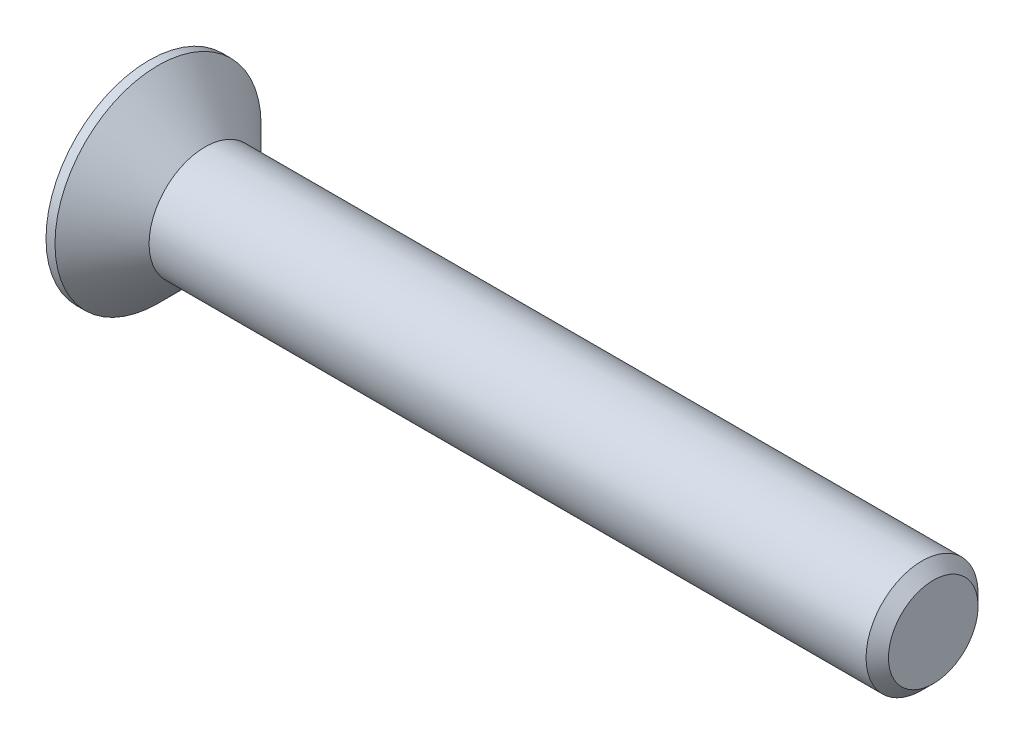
ISO-10303-21;
HEADER;
FILE_DESCRIPTION(('STEP AP214'),'2;1');
FILE_NAME('part.step','',(''),(''),'','','');
FILE_SCHEMA(('AUTOMOTIVE_DESIGN { 1 0 10303 214 1 1 1 1 }'));
ENDSEC;
DATA;
#1=APPLICATION_CONTEXT('core data for automotive mechanical design processes');
#2=APPLICATION_PROTOCOL_DEFINITION('international standard','automotive_design',2000,#1);
#3=PRODUCT_CONTEXT('',#1,'mechanical');
#4=PRODUCT('Part','Part','',(#3));
#5=PRODUCT_RELATED_PRODUCT_CATEGORY('part','',(#4));
#6=PRODUCT_DEFINITION_FORMATION('','',#4);
#7=PRODUCT_DEFINITION_CONTEXT('part definition',#1,'design');
#8=PRODUCT_DEFINITION('design','',#6,#7);
#9=PRODUCT_DEFINITION_SHAPE('','',#8);
#10=(LENGTH_UNIT() NAMED_UNIT(*) SI_UNIT(.MILLI.,.METRE.));
#11=(NAMED_UNIT(*) PLANE_ANGLE_UNIT() SI_UNIT($,.RADIAN.));
#12=(NAMED_UNIT(*) SI_UNIT($,.STERADIAN.) SOLID_ANGLE_UNIT());
#13=UNCERTAINTY_MEASURE_WITH_UNIT(LENGTH_MEASURE(1.E-05),#10,'distance_accuracy_value','');
#14=(GEOMETRIC_REPRESENTATION_CONTEXT(3) GLOBAL_UNCERTAINTY_ASSIGNED_CONTEXT((#13)) GLOBAL_UNIT_ASSIGNED_CONTEXT((#10,
#11,#12)) REPRESENTATION_CONTEXT('',''));
#15=CARTESIAN_POINT('',(0.,0.,0.));
#16=DIRECTION('',(0.,0.,1.));
#17=DIRECTION('',(1.,0.,0.));
#18=AXIS2_PLACEMENT_3D('',#15,#16,#17);
#19=CARTESIAN_POINT('',(0.,0.,0.));
#20=DIRECTION('',(-1.,0.,0.));
#21=DIRECTION('',(0.,0.,1.));
#22=AXIS2_PLACEMENT_3D('',#19,#20,#21);
#23=CONICAL_SURFACE('',#22,2.5,0.78539816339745);
#24=CARTESIAN_POINT('',(-2.09999999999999,0.,0.));
#25=DIRECTION('',(-1.,0.,0.));
#26=DIRECTION('',(0.,0.,1.));
#27=AXIS2_PLACEMENT_3D('',#24,#25,#26);
#28=CIRCLE('',#27,4.6);
#29=CARTESIAN_POINT('',(-2.09999999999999,0.,4.6));
#30=VERTEX_POINT('',#29);
#31=EDGE_CURVE('E189',#30,#30,#28,.T.);
#32=ORIENTED_EDGE('',*,*,#31,.F.);
#33=EDGE_LOOP('',(#32));
#34=FACE_BOUND('',#33,.T.);
#35=CARTESIAN_POINT('',(0.,0.,0.));
#36=DIRECTION('',(-1.,0.,0.));
#37=DIRECTION('',(0.,0.,1.));
#38=AXIS2_PLACEMENT_3D('',#35,#36,#37);
#39=CIRCLE('',#38,2.5);
#40=CARTESIAN_POINT('',(0.,0.,2.5));
#41=VERTEX_POINT('',#40);
#42=EDGE_CURVE('E212',#41,#41,#39,.T.);
#43=ORIENTED_EDGE('',*,*,#42,.T.);
#44=EDGE_LOOP('',(#43));
#45=FACE_BOUND('',#44,.T.);
#46=ADVANCED_FACE('F33',(#34,#45),#23,.T.);
#47=CARTESIAN_POINT('',(-2.5,0.,0.));
#48=DIRECTION('',(-1.,0.,0.));
#49=DIRECTION('',(0.,0.,1.));
#50=AXIS2_PLACEMENT_3D('',#47,#48,#49);
#51=CYLINDRICAL_SURFACE('',#50,2.5);
#52=CARTESIAN_POINT('',(32.,0.,0.));
#53=DIRECTION('',(-1.,0.,0.));
#54=DIRECTION('',(0.,0.,1.));
#55=AXIS2_PLACEMENT_3D('',#52,#53,#54);
#56=CIRCLE('',#55,2.5);
#57=CARTESIAN_POINT('',(32.,0.,2.5));
#58=VERTEX_POINT('',#57);
#59=EDGE_CURVE('E41',#58,#58,#56,.T.);
#60=ORIENTED_EDGE('',*,*,#59,.T.);
#61=EDGE_LOOP('',(#60));
#62=FACE_BOUND('',#61,.T.);
#63=ORIENTED_EDGE('',*,*,#42,.F.);
#64=EDGE_LOOP('',(#63));
#65=FACE_BOUND('',#64,.T.);
#66=ADVANCED_FACE('F217',(#62,#65),#51,.T.);
#67=CARTESIAN_POINT('',(32.5,0.,0.));
#68=DIRECTION('',(-1.,0.,0.));
#69=DIRECTION('',(0.,0.,1.));
#70=AXIS2_PLACEMENT_3D('',#67,#68,#69);
#71=PLANE('',#70);
#72=CARTESIAN_POINT('',(32.5,0.,0.));
#73=DIRECTION('',(-1.,0.,0.));
#74=DIRECTION('',(0.,0.,1.));
#75=AXIS2_PLACEMENT_3D('',#72,#73,#74);
#76=CIRCLE('',#75,2.);
#77=CARTESIAN_POINT('',(32.5,0.,2.));
#78=VERTEX_POINT('',#77);
#79=EDGE_CURVE('E11',#78,#78,#76,.F.);
#80=ORIENTED_EDGE('',*,*,#79,.T.);
#81=EDGE_LOOP('',(#80));
#82=FACE_BOUND('',#81,.T.);
#83=ADVANCED_FACE('F239',(#82),#71,.F.);
#84=CARTESIAN_POINT('',(-2.5,4.6,0.));
#85=DIRECTION('',(1.,0.,0.));
#86=DIRECTION('',(0.,0.,-1.));
#87=AXIS2_PLACEMENT_3D('',#84,#85,#86);
#88=PLANE('',#87);
#89=DIRECTION('',(0.,0.,-1.));
#90=VECTOR('',#89,1.);
#91=CARTESIAN_POINT('',(-2.5,0.575,-2.3));
#92=LINE('',#91,#90);
#93=CARTESIAN_POINT('',(-2.5,0.575,-0.575));
#94=VERTEX_POINT('',#93);
#95=CARTESIAN_POINT('',(-2.5,0.575,-2.3));
#96=VERTEX_POINT('',#95);
#97=EDGE_CURVE('E158',#94,#96,#92,.T.);
#98=ORIENTED_EDGE('',*,*,#97,.F.);
#99=DIRECTION('',(0.,-1.,0.));
#100=VECTOR('',#99,1.);
#101=CARTESIAN_POINT('',(-2.5,0.575,-0.575));
#102=LINE('',#101,#100);
#103=CARTESIAN_POINT('',(-2.5,2.3,-0.575));
#104=VERTEX_POINT('',#103);
#105=EDGE_CURVE('E48',#104,#94,#102,.T.);
#106=ORIENTED_EDGE('',*,*,#105,.F.);
#107=DIRECTION('',(0.,0.,-1.));
#108=VECTOR('',#107,1.);
#109=CARTESIAN_POINT('',(-2.5,2.3,-0.575));
#110=LINE('',#109,#108);
#111=CARTESIAN_POINT('',(-2.5,2.3,0.575));
#112=VERTEX_POINT('',#111);
#113=EDGE_CURVE('E185',#112,#104,#110,.T.);
#114=ORIENTED_EDGE('',*,*,#113,.F.);
#115=DIRECTION('',(0.,1.,0.));
#116=VECTOR('',#115,1.);
#117=CARTESIAN_POINT('',(-2.5,2.3,0.575));
#118=LINE('',#117,#116);
#119=CARTESIAN_POINT('',(-2.5,0.575,0.575));
#120=VERTEX_POINT('',#119);
#121=EDGE_CURVE('E183',#120,#112,#118,.T.);
#122=ORIENTED_EDGE('',*,*,#121,.F.);
#123=DIRECTION('',(0.,0.,-1.));
#124=VECTOR('',#123,1.);
#125=CARTESIAN_POINT('',(-2.5,0.575,0.575));
#126=LINE('',#125,#124);
#127=CARTESIAN_POINT('',(-2.5,0.575,2.3));
#128=VERTEX_POINT('',#127);
#129=EDGE_CURVE('E132',#128,#120,#126,.T.);
#130=ORIENTED_EDGE('',*,*,#129,.F.);
#131=DIRECTION('',(0.,1.,0.));
#132=VECTOR('',#131,1.);
#133=CARTESIAN_POINT('',(-2.5,0.575,2.3));
#134=LINE('',#133,#132);
#135=CARTESIAN_POINT('',(-2.5,-0.575,2.3));
#136=VERTEX_POINT('',#135);
#137=EDGE_CURVE('E179',#136,#128,#134,.T.);
#138=ORIENTED_EDGE('',*,*,#137,.F.);
#139=DIRECTION('',(0.,0.,1.));
#140=VECTOR('',#139,1.);
#141=CARTESIAN_POINT('',(-2.5,-0.575,2.3));
#142=LINE('',#141,#140);
#143=CARTESIAN_POINT('',(-2.5,-0.575,0.575));
#144=VERTEX_POINT('',#143);
#145=EDGE_CURVE('E176',#144,#136,#142,.T.);
#146=ORIENTED_EDGE('',*,*,#145,.F.);
#147=DIRECTION('',(0.,1.,0.));
#148=VECTOR('',#147,1.);
#149=CARTESIAN_POINT('',(-2.5,-0.575,0.575));
#150=LINE('',#149,#148);
#151=CARTESIAN_POINT('',(-2.5,-2.3,0.575));
#152=VERTEX_POINT('',#151);
#153=EDGE_CURVE('E173',#152,#144,#150,.T.);
#154=ORIENTED_EDGE('',*,*,#153,.F.);
#155=DIRECTION('',(0.,0.,1.));
#156=VECTOR('',#155,1.);
#157=CARTESIAN_POINT('',(-2.5,-2.3,0.575));
#158=LINE('',#157,#156);
#159=CARTESIAN_POINT('',(-2.5,-2.3,-0.575));
#160=VERTEX_POINT('',#159);
#161=EDGE_CURVE('E170',#160,#152,#158,.T.);
#162=ORIENTED_EDGE('',*,*,#161,.F.);
#163=DIRECTION('',(0.,-1.,0.));
#164=VECTOR('',#163,1.);
#165=CARTESIAN_POINT('',(-2.5,-2.3,-0.575));
#166=LINE('',#165,#164);
#167=CARTESIAN_POINT('',(-2.5,-0.575,-0.575));
#168=VERTEX_POINT('',#167);
#169=EDGE_CURVE('E167',#168,#160,#166,.T.);
#170=ORIENTED_EDGE('',*,*,#169,.F.);
#171=DIRECTION('',(0.,0.,1.));
#172=VECTOR('',#171,1.);
#173=CARTESIAN_POINT('',(-2.5,-0.575,-0.575));
#174=LINE('',#173,#172);
#175=CARTESIAN_POINT('',(-2.5,-0.575,-2.3));
#176=VERTEX_POINT('',#175);
#177=EDGE_CURVE('E164',#176,#168,#174,.T.);
#178=ORIENTED_EDGE('',*,*,#177,.F.);
#179=DIRECTION('',(0.,-1.,0.));
#180=VECTOR('',#179,1.);
#181=CARTESIAN_POINT('',(-2.5,-0.575,-2.3));
#182=LINE('',#181,#180);
#183=EDGE_CURVE('E161',#96,#176,#182,.T.);
#184=ORIENTED_EDGE('',*,*,#183,.F.);
#185=EDGE_LOOP('',(#98,#106,#114,#122,#130,#138,#146,#154,#162,#170,#178,#184));
#186=FACE_BOUND('',#185,.T.);
#187=CARTESIAN_POINT('',(-2.5,0.,0.));
#188=DIRECTION('',(-1.,0.,0.));
#189=DIRECTION('',(0.,0.,1.));
#190=AXIS2_PLACEMENT_3D('',#187,#188,#189);
#191=CIRCLE('',#190,4.6);
#192=CARTESIAN_POINT('',(-2.5,0.,4.6));
#193=VERTEX_POINT('',#192);
#194=EDGE_CURVE('E209',#193,#193,#191,.T.);
#195=ORIENTED_EDGE('',*,*,#194,.T.);
#196=EDGE_LOOP('',(#195));
#197=FACE_BOUND('',#196,.T.);
#198=ADVANCED_FACE('F230',(#186,#197),#88,.F.);
#199=CARTESIAN_POINT('',(-2.5,0.,0.));
#200=DIRECTION('',(-1.,0.,0.));
#201=DIRECTION('',(0.,0.,1.));
#202=AXIS2_PLACEMENT_3D('',#199,#200,#201);
#203=CYLINDRICAL_SURFACE('',#202,4.6);
#204=ORIENTED_EDGE('',*,*,#194,.F.);
#205=EDGE_LOOP('',(#204));
#206=FACE_BOUND('',#205,.T.);
#207=ORIENTED_EDGE('',*,*,#31,.T.);
#208=EDGE_LOOP('',(#207));
#209=FACE_BOUND('',#208,.T.);
#210=ADVANCED_FACE('F222',(#206,#209),#203,.T.);
#211=CARTESIAN_POINT('',(32.,0.,0.));
#212=DIRECTION('',(-1.,0.,0.));
#213=DIRECTION('',(0.,0.,1.));
#214=AXIS2_PLACEMENT_3D('',#211,#212,#213);
#215=CONICAL_SURFACE('',#214,2.5,0.785398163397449);
#216=ORIENTED_EDGE('',*,*,#79,.F.);
#217=EDGE_LOOP('',(#216));
#218=FACE_BOUND('',#217,.T.);
#219=ORIENTED_EDGE('',*,*,#59,.F.);
#220=EDGE_LOOP('',(#219));
#221=FACE_BOUND('',#220,.T.);
#222=ADVANCED_FACE('F35',(#218,#221),#215,.T.);
#223=CARTESIAN_POINT('',(-0.4,0.575,-0.575));
#224=DIRECTION('',(0.,0.,-1.));
#225=DIRECTION('',(-1.,0.,0.));
#226=AXIS2_PLACEMENT_3D('',#223,#224,#225);
#227=PLANE('',#226);
#228=ORIENTED_EDGE('',*,*,#105,.T.);
#229=DIRECTION('',(-1.,0.,0.));
#230=VECTOR('',#229,1.);
#231=CARTESIAN_POINT('',(-0.4,0.575,-0.575));
#232=LINE('',#231,#230);
#233=CARTESIAN_POINT('',(-0.4,0.575,-0.575));
#234=VERTEX_POINT('',#233);
#235=EDGE_CURVE('E96',#234,#94,#232,.T.);
#236=ORIENTED_EDGE('',*,*,#235,.F.);
#237=DIRECTION('',(0.,-1.,0.));
#238=VECTOR('',#237,1.);
#239=CARTESIAN_POINT('',(-0.4,0.575,-0.575));
#240=LINE('',#239,#238);
#241=CARTESIAN_POINT('',(-0.4,2.3,-0.575));
#242=VERTEX_POINT('',#241);
#243=EDGE_CURVE('E187',#242,#234,#240,.T.);
#244=ORIENTED_EDGE('',*,*,#243,.F.);
#245=DIRECTION('',(-1.,0.,0.));
#246=VECTOR('',#245,1.);
#247=CARTESIAN_POINT('',(-0.4,2.3,-0.575));
#248=LINE('',#247,#246);
#249=EDGE_CURVE('E56',#242,#104,#248,.T.);
#250=ORIENTED_EDGE('',*,*,#249,.T.);
#251=EDGE_LOOP('',(#228,#236,#244,#250));
#252=FACE_BOUND('',#251,.T.);
#253=ADVANCED_FACE('F221',(#252),#227,.F.);
#254=CARTESIAN_POINT('',(-0.4,2.3,-0.575));
#255=DIRECTION('',(0.,1.,0.));
#256=DIRECTION('',(-1.,0.,0.));
#257=AXIS2_PLACEMENT_3D('',#254,#255,#256);
#258=PLANE('',#257);
#259=ORIENTED_EDGE('',*,*,#113,.T.);
#260=ORIENTED_EDGE('',*,*,#249,.F.);
#261=DIRECTION('',(0.,0.,-1.));
#262=VECTOR('',#261,1.);
#263=CARTESIAN_POINT('',(-0.4,2.3,-0.575));
#264=LINE('',#263,#262);
#265=CARTESIAN_POINT('',(-0.4,2.3,0.575));
#266=VERTEX_POINT('',#265);
#267=EDGE_CURVE('E144',#266,#242,#264,.T.);
#268=ORIENTED_EDGE('',*,*,#267,.F.);
#269=DIRECTION('',(-1.,0.,0.));
#270=VECTOR('',#269,1.);
#271=CARTESIAN_POINT('',(-0.4,2.3,0.575));
#272=LINE('',#271,#270);
#273=EDGE_CURVE('E136',#266,#112,#272,.T.);
#274=ORIENTED_EDGE('',*,*,#273,.T.);
#275=EDGE_LOOP('',(#259,#260,#268,#274));
#276=FACE_BOUND('',#275,.T.);
#277=ADVANCED_FACE('F228',(#276),#258,.F.);
#278=CARTESIAN_POINT('',(-0.4,2.3,0.575));
#279=DIRECTION('',(0.,0.,1.));
#280=DIRECTION('',(1.,0.,0.));
#281=AXIS2_PLACEMENT_3D('',#278,#279,#280);
#282=PLANE('',#281);
#283=ORIENTED_EDGE('',*,*,#121,.T.);
#284=ORIENTED_EDGE('',*,*,#273,.F.);
#285=DIRECTION('',(0.,1.,0.));
#286=VECTOR('',#285,1.);
#287=CARTESIAN_POINT('',(-0.4,2.3,0.575));
#288=LINE('',#287,#286);
#289=CARTESIAN_POINT('',(-0.4,0.575,0.575));
#290=VERTEX_POINT('',#289);
#291=EDGE_CURVE('E140',#290,#266,#288,.T.);
#292=ORIENTED_EDGE('',*,*,#291,.F.);
#293=DIRECTION('',(-1.,0.,0.));
#294=VECTOR('',#293,1.);
#295=CARTESIAN_POINT('',(-0.4,0.575,0.575));
#296=LINE('',#295,#294);
#297=EDGE_CURVE('E125',#290,#120,#296,.T.);
#298=ORIENTED_EDGE('',*,*,#297,.T.);
#299=EDGE_LOOP('',(#283,#284,#292,#298));
#300=FACE_BOUND('',#299,.T.);
#301=ADVANCED_FACE('F141',(#300),#282,.F.);
#302=CARTESIAN_POINT('',(-0.4,0.575,0.575));
#303=DIRECTION('',(0.,1.,0.));
#304=DIRECTION('',(-1.,0.,0.));
#305=AXIS2_PLACEMENT_3D('',#302,#303,#304);
#306=PLANE('',#305);
#307=ORIENTED_EDGE('',*,*,#129,.T.);
#308=ORIENTED_EDGE('',*,*,#297,.F.);
#309=DIRECTION('',(0.,0.,-1.));
#310=VECTOR('',#309,1.);
#311=CARTESIAN_POINT('',(-0.4,0.575,0.575));
#312=LINE('',#311,#310);
#313=CARTESIAN_POINT('',(-0.4,0.575,2.3));
#314=VERTEX_POINT('',#313);
#315=EDGE_CURVE('E129',#314,#290,#312,.T.);
#316=ORIENTED_EDGE('',*,*,#315,.F.);
#317=DIRECTION('',(-1.,0.,0.));
#318=VECTOR('',#317,1.);
#319=CARTESIAN_POINT('',(-0.4,0.575,2.3));
#320=LINE('',#319,#318);
#321=EDGE_CURVE('E137',#314,#128,#320,.T.);
#322=ORIENTED_EDGE('',*,*,#321,.T.);
#323=EDGE_LOOP('',(#307,#308,#316,#322));
#324=FACE_BOUND('',#323,.T.);
#325=ADVANCED_FACE('F127',(#324),#306,.F.);
#326=CARTESIAN_POINT('',(-0.4,0.575,2.3));
#327=DIRECTION('',(0.,0.,1.));
#328=DIRECTION('',(1.,0.,0.));
#329=AXIS2_PLACEMENT_3D('',#326,#327,#328);
#330=PLANE('',#329);
#331=ORIENTED_EDGE('',*,*,#137,.T.);
#332=ORIENTED_EDGE('',*,*,#321,.F.);
#333=DIRECTION('',(0.,1.,0.));
#334=VECTOR('',#333,1.);
#335=CARTESIAN_POINT('',(-0.4,0.575,2.3));
#336=LINE('',#335,#334);
#337=CARTESIAN_POINT('',(-0.4,-0.575,2.3));
#338=VERTEX_POINT('',#337);
#339=EDGE_CURVE('E150',#338,#314,#336,.T.);
#340=ORIENTED_EDGE('',*,*,#339,.F.);
#341=DIRECTION('',(-1.,0.,0.));
#342=VECTOR('',#341,1.);
#343=CARTESIAN_POINT('',(-0.4,-0.575,2.3));
#344=LINE('',#343,#342);
#345=EDGE_CURVE('E192',#338,#136,#344,.T.);
#346=ORIENTED_EDGE('',*,*,#345,.T.);
#347=EDGE_LOOP('',(#331,#332,#340,#346));
#348=FACE_BOUND('',#347,.T.);
#349=ADVANCED_FACE('F277',(#348),#330,.F.);
#350=CARTESIAN_POINT('',(-0.4,-0.575,2.3));
#351=DIRECTION('',(0.,-1.,0.));
#352=DIRECTION('',(1.,0.,0.));
#353=AXIS2_PLACEMENT_3D('',#350,#351,#352);
#354=PLANE('',#353);
#355=ORIENTED_EDGE('',*,*,#145,.T.);
#356=ORIENTED_EDGE('',*,*,#345,.F.);
#357=DIRECTION('',(0.,0.,1.));
#358=VECTOR('',#357,1.);
#359=CARTESIAN_POINT('',(-0.4,-0.575,2.3));
#360=LINE('',#359,#358);
#361=CARTESIAN_POINT('',(-0.4,-0.575,0.575));
#362=VERTEX_POINT('',#361);
#363=EDGE_CURVE('E152',#362,#338,#360,.T.);
#364=ORIENTED_EDGE('',*,*,#363,.F.);
#365=DIRECTION('',(-1.,0.,0.));
#366=VECTOR('',#365,1.);
#367=CARTESIAN_POINT('',(-0.4,-0.575,0.575));
#368=LINE('',#367,#366);
#369=EDGE_CURVE('E194',#362,#144,#368,.T.);
#370=ORIENTED_EDGE('',*,*,#369,.T.);
#371=EDGE_LOOP('',(#355,#356,#364,#370));
#372=FACE_BOUND('',#371,.T.);
#373=ADVANCED_FACE('F273',(#372),#354,.F.);
#374=CARTESIAN_POINT('',(-0.4,-0.575,0.575));
#375=DIRECTION('',(0.,0.,1.));
#376=DIRECTION('',(1.,0.,0.));
#377=AXIS2_PLACEMENT_3D('',#374,#375,#376);
#378=PLANE('',#377);
#379=ORIENTED_EDGE('',*,*,#153,.T.);
#380=ORIENTED_EDGE('',*,*,#369,.F.);
#381=DIRECTION('',(0.,1.,0.));
#382=VECTOR('',#381,1.);
#383=CARTESIAN_POINT('',(-0.4,-0.575,0.575));
#384=LINE('',#383,#382);
#385=CARTESIAN_POINT('',(-0.4,-2.3,0.575));
#386=VERTEX_POINT('',#385);
#387=EDGE_CURVE('E422',#386,#362,#384,.T.);
#388=ORIENTED_EDGE('',*,*,#387,.F.);
#389=DIRECTION('',(-1.,0.,0.));
#390=VECTOR('',#389,1.);
#391=CARTESIAN_POINT('',(-0.4,-2.3,0.575));
#392=LINE('',#391,#390);
#393=EDGE_CURVE('E196',#386,#152,#392,.T.);
#394=ORIENTED_EDGE('',*,*,#393,.T.);
#395=EDGE_LOOP('',(#379,#380,#388,#394));
#396=FACE_BOUND('',#395,.T.);
#397=ADVANCED_FACE('F269',(#396),#378,.F.);
#398=CARTESIAN_POINT('',(-0.4,-2.3,0.575));
#399=DIRECTION('',(0.,-1.,0.));
#400=DIRECTION('',(1.,0.,0.));
#401=AXIS2_PLACEMENT_3D('',#398,#399,#400);
#402=PLANE('',#401);
#403=ORIENTED_EDGE('',*,*,#161,.T.);
#404=ORIENTED_EDGE('',*,*,#393,.F.);
#405=DIRECTION('',(0.,0.,1.));
#406=VECTOR('',#405,1.);
#407=CARTESIAN_POINT('',(-0.4,-2.3,0.575));
#408=LINE('',#407,#406);
#409=CARTESIAN_POINT('',(-0.4,-2.3,-0.575));
#410=VERTEX_POINT('',#409);
#411=EDGE_CURVE('E419',#410,#386,#408,.T.);
#412=ORIENTED_EDGE('',*,*,#411,.F.);
#413=DIRECTION('',(-1.,0.,0.));
#414=VECTOR('',#413,1.);
#415=CARTESIAN_POINT('',(-0.4,-2.3,-0.575));
#416=LINE('',#415,#414);
#417=EDGE_CURVE('E198',#410,#160,#416,.T.);
#418=ORIENTED_EDGE('',*,*,#417,.T.);
#419=EDGE_LOOP('',(#403,#404,#412,#418));
#420=FACE_BOUND('',#419,.T.);
#421=ADVANCED_FACE('F265',(#420),#402,.F.);
#422=CARTESIAN_POINT('',(-0.4,-2.3,-0.575));
#423=DIRECTION('',(0.,0.,-1.));
#424=DIRECTION('',(-1.,0.,0.));
#425=AXIS2_PLACEMENT_3D('',#422,#423,#424);
#426=PLANE('',#425);
#427=ORIENTED_EDGE('',*,*,#169,.T.);
#428=ORIENTED_EDGE('',*,*,#417,.F.);
#429=DIRECTION('',(0.,-1.,0.));
#430=VECTOR('',#429,1.);
#431=CARTESIAN_POINT('',(-0.4,-2.3,-0.575));
#432=LINE('',#431,#430);
#433=CARTESIAN_POINT('',(-0.4,-0.575,-0.575));
#434=VERTEX_POINT('',#433);
#435=EDGE_CURVE('E416',#434,#410,#432,.T.);
#436=ORIENTED_EDGE('',*,*,#435,.F.);
#437=DIRECTION('',(-1.,0.,0.));
#438=VECTOR('',#437,1.);
#439=CARTESIAN_POINT('',(-0.4,-0.575,-0.575));
#440=LINE('',#439,#438);
#441=EDGE_CURVE('E200',#434,#168,#440,.T.);
#442=ORIENTED_EDGE('',*,*,#441,.T.);
#443=EDGE_LOOP('',(#427,#428,#436,#442));
#444=FACE_BOUND('',#443,.T.);
#445=ADVANCED_FACE('F261',(#444),#426,.F.);
#446=CARTESIAN_POINT('',(-0.4,-0.575,-0.575));
#447=DIRECTION('',(0.,-1.,0.));
#448=DIRECTION('',(1.,0.,0.));
#449=AXIS2_PLACEMENT_3D('',#446,#447,#448);
#450=PLANE('',#449);
#451=ORIENTED_EDGE('',*,*,#177,.T.);
#452=ORIENTED_EDGE('',*,*,#441,.F.);
#453=DIRECTION('',(0.,0.,1.));
#454=VECTOR('',#453,1.);
#455=CARTESIAN_POINT('',(-0.4,-0.575,-0.575));
#456=LINE('',#455,#454);
#457=CARTESIAN_POINT('',(-0.4,-0.575,-2.3));
#458=VERTEX_POINT('',#457);
#459=EDGE_CURVE('E413',#458,#434,#456,.T.);
#460=ORIENTED_EDGE('',*,*,#459,.F.);
#461=DIRECTION('',(-1.,0.,0.));
#462=VECTOR('',#461,1.);
#463=CARTESIAN_POINT('',(-0.4,-0.575,-2.3));
#464=LINE('',#463,#462);
#465=EDGE_CURVE('E202',#458,#176,#464,.T.);
#466=ORIENTED_EDGE('',*,*,#465,.T.);
#467=EDGE_LOOP('',(#451,#452,#460,#466));
#468=FACE_BOUND('',#467,.T.);
#469=ADVANCED_FACE('F257',(#468),#450,.F.);
#470=CARTESIAN_POINT('',(-0.4,-0.575,-2.3));
#471=DIRECTION('',(0.,0.,-1.));
#472=DIRECTION('',(-1.,0.,0.));
#473=AXIS2_PLACEMENT_3D('',#470,#471,#472);
#474=PLANE('',#473);
#475=ORIENTED_EDGE('',*,*,#183,.T.);
#476=ORIENTED_EDGE('',*,*,#465,.F.);
#477=DIRECTION('',(0.,-1.,0.));
#478=VECTOR('',#477,1.);
#479=CARTESIAN_POINT('',(-0.4,-0.575,-2.3));
#480=LINE('',#479,#478);
#481=CARTESIAN_POINT('',(-0.4,0.575,-2.3));
#482=VERTEX_POINT('',#481);
#483=EDGE_CURVE('E408',#482,#458,#480,.T.);
#484=ORIENTED_EDGE('',*,*,#483,.F.);
#485=DIRECTION('',(-1.,0.,0.));
#486=VECTOR('',#485,1.);
#487=CARTESIAN_POINT('',(-0.4,0.575,-2.3));
#488=LINE('',#487,#486);
#489=EDGE_CURVE('E204',#482,#96,#488,.T.);
#490=ORIENTED_EDGE('',*,*,#489,.T.);
#491=EDGE_LOOP('',(#475,#476,#484,#490));
#492=FACE_BOUND('',#491,.T.);
#493=ADVANCED_FACE('F253',(#492),#474,.F.);
#494=CARTESIAN_POINT('',(-0.4,0.575,-2.3));
#495=DIRECTION('',(0.,1.,0.));
#496=DIRECTION('',(-1.,0.,0.));
#497=AXIS2_PLACEMENT_3D('',#494,#495,#496);
#498=PLANE('',#497);
#499=ORIENTED_EDGE('',*,*,#97,.T.);
#500=ORIENTED_EDGE('',*,*,#489,.F.);
#501=DIRECTION('',(0.,0.,-1.));
#502=VECTOR('',#501,1.);
#503=CARTESIAN_POINT('',(-0.4,0.575,-2.3));
#504=LINE('',#503,#502);
#505=EDGE_CURVE('E406',#234,#482,#504,.T.);
#506=ORIENTED_EDGE('',*,*,#505,.F.);
#507=ORIENTED_EDGE('',*,*,#235,.T.);
#508=EDGE_LOOP('',(#499,#500,#506,#507));
#509=FACE_BOUND('',#508,.T.);
#510=ADVANCED_FACE('F250',(#509),#498,.F.);
#511=CARTESIAN_POINT('',(-0.4,0.,0.));
#512=DIRECTION('',(1.,0.,0.));
#513=DIRECTION('',(0.,0.,-1.));
#514=AXIS2_PLACEMENT_3D('',#511,#512,#513);
#515=PLANE('',#514);
#516=ORIENTED_EDGE('',*,*,#243,.T.);
#517=ORIENTED_EDGE('',*,*,#505,.T.);
#518=ORIENTED_EDGE('',*,*,#483,.T.);
#519=ORIENTED_EDGE('',*,*,#459,.T.);
#520=ORIENTED_EDGE('',*,*,#435,.T.);
#521=ORIENTED_EDGE('',*,*,#411,.T.);
#522=ORIENTED_EDGE('',*,*,#387,.T.);
#523=ORIENTED_EDGE('',*,*,#363,.T.);
#524=ORIENTED_EDGE('',*,*,#339,.T.);
#525=ORIENTED_EDGE('',*,*,#315,.T.);
#526=ORIENTED_EDGE('',*,*,#291,.T.);
#527=ORIENTED_EDGE('',*,*,#267,.T.);
#528=EDGE_LOOP('',(#516,#517,#518,#519,#520,#521,#522,#523,#524,#525,#526,#527));
#529=FACE_BOUND('',#528,.T.);
#530=ADVANCED_FACE('F147',(#529),#515,.F.);
#531=CLOSED_SHELL('',(#46,#66,#83,#198,#210,#222,#253,#277,#301,#325,#349,#373,#397,#421,#445,
#469,#493,#510,#530));
#532=MANIFOLD_SOLID_BREP('B2',#531);
#533=ADVANCED_BREP_SHAPE_REPRESENTATION('',(#18,#532),#14);
#534=SHAPE_DEFINITION_REPRESENTATION(#9,#533);
ENDSEC;
END-ISO-10303-21;
